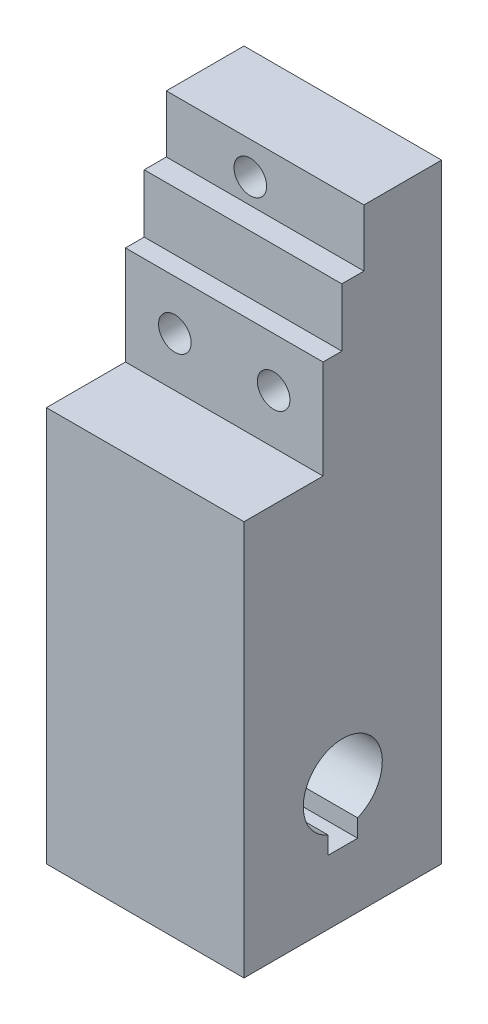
from build123d import *

# Parameters (mm, degrees)
SKETCH_1_W          = 20
SKETCH_1_H          = 61.7
EXTRUDE_1_DEPTH     = 20
SKETCH_2_OUTSIDE_W  = 35.574
SKETCH_2_OUTSIDE_H  = 77.274
CUT_EXTRUDE_1_DEPTH = 20
CUT_EXTRUDE_3_DEPTH = 20
SKETCH_10_R         = 1.65
CUT_EXTRUDE_4_DEPTH = 8
SKETCH_12_R         = 1.65
CUT_EXTRUDE_5_DEPTH = 66.961276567


with BuildPart() as part:
    # Sketch 1 → Extrude 1 (new body)
    with BuildSketch(Plane.XY):
        with Locations((10, 30.85)):
            Rectangle(SKETCH_1_W, SKETCH_1_H)
    extrude(amount=EXTRUDE_1_DEPTH)

    # Sketch 2 outside → Cut-Extrude 1 (cut)
    with BuildSketch(Plane(origin=(20, 0, 0), x_dir=(0, 0, -1), z_dir=(1, 0, 0))):
        with Locations((-10, 30.85)):
            Rectangle(SKETCH_2_OUTSIDE_W, SKETCH_2_OUTSIDE_H)
        Polygon((-10.1, 50), (-10.1, 55.9), (-7.86, 55.9), (-7.86, 61.7), (0, 61.7), (0, 0), (-20, 0), (-20, 40), (-12, 40), (-12, 50), align=None, mode=Mode.SUBTRACT)
    extrude(amount=-CUT_EXTRUDE_1_DEPTH, mode=Mode.SUBTRACT)

    # Sketch 8 → Cut-Extrude 3 (cut)
    with BuildSketch(Plane(origin=(20, 0, 0), x_dir=(0, 0, -1), z_dir=(1, 0, 0))):
        with BuildLine():
            Line((-8.5, 6.5), (-8.5, 8.291900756))
            ThreePointArc((-8.5, 8.291900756), (-10, 16), (-11.5, 8.291900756))
            Line((-11.5, 8.291900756), (-11.5, 6.5))
            Line((-11.5, 6.5), (-8.5, 6.5))
        make_face()
    extrude(amount=-CUT_EXTRUDE_3_DEPTH, mode=Mode.SUBTRACT)

    # Sketch 10 → Cut-Extrude 4 (cut)
    with BuildSketch(Plane(origin=(0, 0, 0), x_dir=(-1, 0, 0), z_dir=(0, 0, -1))):
        with Locations((-10, 12)):
            Circle(SKETCH_10_R)
    extrude(amount=-CUT_EXTRUDE_4_DEPTH, mode=Mode.SUBTRACT)

    # Sketch 12 → Cut-Extrude 5 (cut, through all)
    with BuildSketch(Plane.XY.offset(12)):
        with Locations((5, 45)):
            Circle(SKETCH_12_R)
        with Locations((15, 45)):
            Circle(SKETCH_12_R)
        with Locations((8.5, 58.4)):
            Circle(SKETCH_12_R)
    extrude(amount=-CUT_EXTRUDE_5_DEPTH, mode=Mode.SUBTRACT)


solid = part.part
